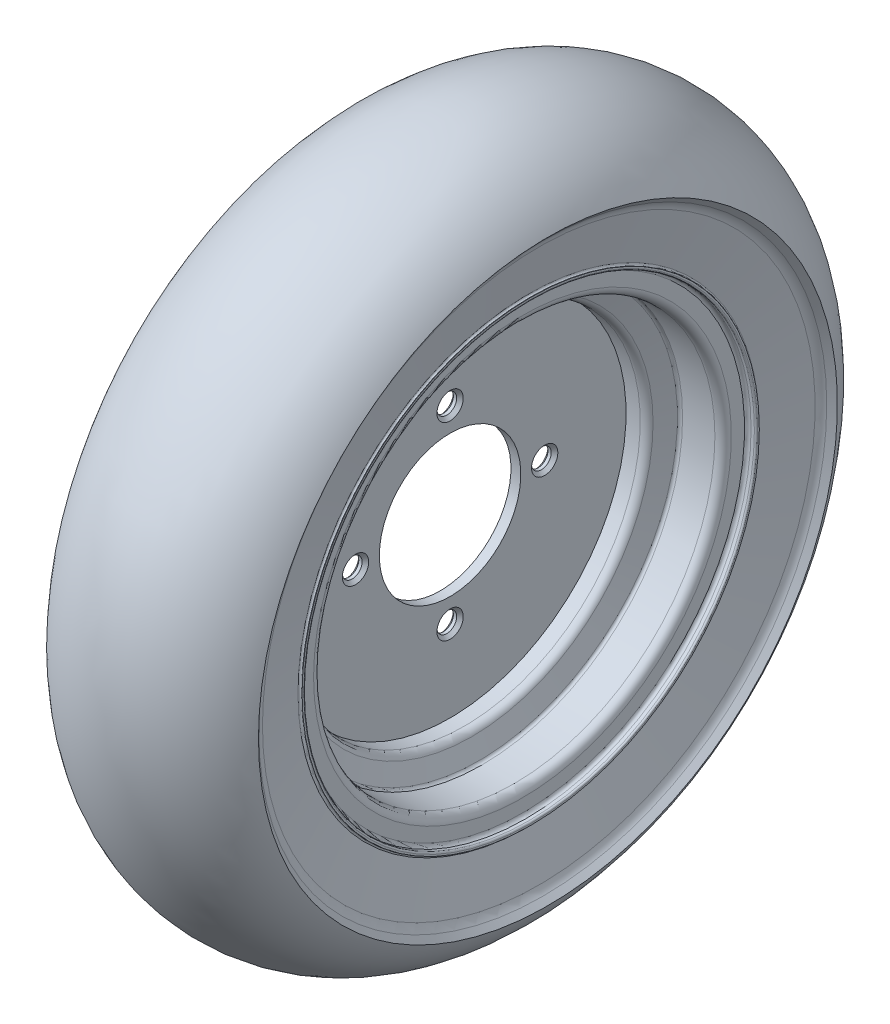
ISO-10303-21;
HEADER;
FILE_DESCRIPTION(('STEP AP214'),'2;1');
FILE_NAME('part.step','',(''),(''),'','','');
FILE_SCHEMA(('AUTOMOTIVE_DESIGN { 1 0 10303 214 1 1 1 1 }'));
ENDSEC;
DATA;
#1=APPLICATION_CONTEXT('core data for automotive mechanical design processes');
#2=APPLICATION_PROTOCOL_DEFINITION('international standard','automotive_design',2000,#1);
#3=PRODUCT_CONTEXT('',#1,'mechanical');
#4=PRODUCT('Part','Part','',(#3));
#5=PRODUCT_RELATED_PRODUCT_CATEGORY('part','',(#4));
#6=PRODUCT_DEFINITION_FORMATION('','',#4);
#7=PRODUCT_DEFINITION_CONTEXT('part definition',#1,'design');
#8=PRODUCT_DEFINITION('design','',#6,#7);
#9=PRODUCT_DEFINITION_SHAPE('','',#8);
#10=(LENGTH_UNIT() NAMED_UNIT(*) SI_UNIT(.MILLI.,.METRE.));
#11=(NAMED_UNIT(*) PLANE_ANGLE_UNIT() SI_UNIT($,.RADIAN.));
#12=(NAMED_UNIT(*) SI_UNIT($,.STERADIAN.) SOLID_ANGLE_UNIT());
#13=UNCERTAINTY_MEASURE_WITH_UNIT(LENGTH_MEASURE(1.E-05),#10,'distance_accuracy_value','');
#14=(GEOMETRIC_REPRESENTATION_CONTEXT(3) GLOBAL_UNCERTAINTY_ASSIGNED_CONTEXT((#13)) GLOBAL_UNIT_ASSIGNED_CONTEXT((#10,
#11,#12)) REPRESENTATION_CONTEXT('',''));
#15=CARTESIAN_POINT('',(0.,0.,0.));
#16=DIRECTION('',(0.,0.,1.));
#17=DIRECTION('',(1.,0.,0.));
#18=AXIS2_PLACEMENT_3D('',#15,#16,#17);
#19=CARTESIAN_POINT('',(-3.00000000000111,107.,-3.33066907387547E-13));
#20=DIRECTION('',(1.,0.,0.));
#21=DIRECTION('',(0.,0.,-0.999999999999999));
#22=AXIS2_PLACEMENT_3D('',#19,#20,#21);
#23=PLANE('',#22);
#24=CARTESIAN_POINT('',(-3.00000000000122,57.4999999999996,-1.11022302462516E-13));
#25=DIRECTION('',(1.,0.,0.));
#26=DIRECTION('',(0.,0.,-0.999999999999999));
#27=AXIS2_PLACEMENT_3D('',#24,#25,#26);
#28=CIRCLE('',#27,8.00000000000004);
#29=CARTESIAN_POINT('',(-3.00000000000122,57.4999999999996,-8.00000000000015));
#30=VERTEX_POINT('',#29);
#31=EDGE_CURVE('E74',#30,#30,#28,.T.);
#32=ORIENTED_EDGE('',*,*,#31,.T.);
#33=EDGE_LOOP('',(#32));
#34=FACE_BOUND('',#33,.T.);
#35=CARTESIAN_POINT('',(-3.00000000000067,-2.77555756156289E-13,-57.5000000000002));
#36=DIRECTION('',(1.,0.,0.));
#37=DIRECTION('',(0.,0.,-0.999999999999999));
#38=AXIS2_PLACEMENT_3D('',#35,#36,#37);
#39=CIRCLE('',#38,8.00000000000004);
#40=CARTESIAN_POINT('',(-3.00000000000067,-2.72670774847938E-13,-65.5000000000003));
#41=VERTEX_POINT('',#40);
#42=EDGE_CURVE('E77',#41,#41,#39,.T.);
#43=ORIENTED_EDGE('',*,*,#42,.T.);
#44=EDGE_LOOP('',(#43));
#45=FACE_BOUND('',#44,.T.);
#46=CARTESIAN_POINT('',(-3.00000000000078,-57.5,-2.22044604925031E-13));
#47=DIRECTION('',(1.,0.,0.));
#48=DIRECTION('',(0.,0.,-0.999999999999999));
#49=AXIS2_PLACEMENT_3D('',#46,#47,#48);
#50=CIRCLE('',#49,8.00000000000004);
#51=CARTESIAN_POINT('',(-3.00000000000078,-57.5,-8.00000000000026));
#52=VERTEX_POINT('',#51);
#53=EDGE_CURVE('E80',#52,#52,#50,.T.);
#54=ORIENTED_EDGE('',*,*,#53,.T.);
#55=EDGE_LOOP('',(#54));
#56=FACE_BOUND('',#55,.T.);
#57=CARTESIAN_POINT('',(-3.00000000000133,-4.44089209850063E-13,57.4999999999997));
#58=DIRECTION('',(1.,0.,0.));
#59=DIRECTION('',(0.,0.,-0.999999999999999));
#60=AXIS2_PLACEMENT_3D('',#57,#58,#59);
#61=CIRCLE('',#60,8.00000000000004);
#62=CARTESIAN_POINT('',(-3.00000000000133,-4.39204228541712E-13,49.4999999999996));
#63=VERTEX_POINT('',#62);
#64=EDGE_CURVE('E83',#63,#63,#61,.T.);
#65=ORIENTED_EDGE('',*,*,#64,.T.);
#66=EDGE_LOOP('',(#65));
#67=FACE_BOUND('',#66,.T.);
#68=CARTESIAN_POINT('',(-3.00000000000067,-1.94289029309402E-13,-2.22044604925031E-13));
#69=DIRECTION('',(-1.,0.,0.));
#70=DIRECTION('',(0.,0.,0.999999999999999));
#71=AXIS2_PLACEMENT_3D('',#68,#69,#70);
#72=CIRCLE('',#71,43.);
#73=CARTESIAN_POINT('',(-3.00000000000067,-2.20545803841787E-13,42.9999999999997));
#74=VERTEX_POINT('',#73);
#75=EDGE_CURVE('E86',#74,#74,#72,.T.);
#76=ORIENTED_EDGE('',*,*,#75,.F.);
#77=EDGE_LOOP('',(#76));
#78=FACE_BOUND('',#77,.T.);
#79=CARTESIAN_POINT('',(-3.00000000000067,-1.94289029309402E-13,-2.22044604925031E-13));
#80=DIRECTION('',(-1.,0.,0.));
#81=DIRECTION('',(0.,0.,0.999999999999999));
#82=AXIS2_PLACEMENT_3D('',#79,#80,#81);
#83=CIRCLE('',#82,107.);
#84=CARTESIAN_POINT('',(-3.00000000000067,-2.59625654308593E-13,107.));
#85=VERTEX_POINT('',#84);
#86=EDGE_CURVE('E89',#85,#85,#83,.T.);
#87=ORIENTED_EDGE('',*,*,#86,.T.);
#88=EDGE_LOOP('',(#87));
#89=FACE_BOUND('',#88,.T.);
#90=ADVANCED_FACE('F30',(#34,#45,#56,#67,#78,#89),#23,.F.);
#91=CARTESIAN_POINT('',(2.99999999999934,107.,-3.33066907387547E-13));
#92=DIRECTION('',(-1.,0.,0.));
#93=DIRECTION('',(0.,0.,-0.999999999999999));
#94=AXIS2_PLACEMENT_3D('',#91,#92,#93);
#95=PLANE('',#94);
#96=CARTESIAN_POINT('',(3.00000000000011,-57.5,-1.11022302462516E-13));
#97=DIRECTION('',(-1.,0.,0.));
#98=DIRECTION('',(0.,0.,0.999999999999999));
#99=AXIS2_PLACEMENT_3D('',#96,#97,#98);
#100=CIRCLE('',#99,8.00000000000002);
#101=CARTESIAN_POINT('',(3.00000000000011,-57.5,7.9999999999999));
#102=VERTEX_POINT('',#101);
#103=EDGE_CURVE('E50',#102,#102,#100,.T.);
#104=ORIENTED_EDGE('',*,*,#103,.T.);
#105=EDGE_LOOP('',(#104));
#106=FACE_BOUND('',#105,.T.);
#107=CARTESIAN_POINT('',(3.00000000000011,0.,-57.5));
#108=DIRECTION('',(-1.,0.,0.));
#109=DIRECTION('',(0.,0.,0.999999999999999));
#110=AXIS2_PLACEMENT_3D('',#107,#108,#109);
#111=CIRCLE('',#110,8.00000000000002);
#112=CARTESIAN_POINT('',(3.00000000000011,0.,-49.5));
#113=VERTEX_POINT('',#112);
#114=EDGE_CURVE('E53',#113,#113,#111,.T.);
#115=ORIENTED_EDGE('',*,*,#114,.T.);
#116=EDGE_LOOP('',(#115));
#117=FACE_BOUND('',#116,.T.);
#118=CARTESIAN_POINT('',(3.00000000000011,57.5,-3.33066907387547E-13));
#119=DIRECTION('',(-1.,0.,0.));
#120=DIRECTION('',(0.,0.,0.999999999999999));
#121=AXIS2_PLACEMENT_3D('',#118,#119,#120);
#122=CIRCLE('',#121,8.00000000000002);
#123=CARTESIAN_POINT('',(3.00000000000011,57.5,7.99999999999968));
#124=VERTEX_POINT('',#123);
#125=EDGE_CURVE('E56',#124,#124,#122,.T.);
#126=ORIENTED_EDGE('',*,*,#125,.T.);
#127=EDGE_LOOP('',(#126));
#128=FACE_BOUND('',#127,.T.);
#129=CARTESIAN_POINT('',(2.99999999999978,-1.94289029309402E-13,57.5));
#130=DIRECTION('',(-1.,0.,0.));
#131=DIRECTION('',(0.,0.,0.999999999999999));
#132=AXIS2_PLACEMENT_3D('',#129,#130,#131);
#133=CIRCLE('',#132,8.00000000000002);
#134=CARTESIAN_POINT('',(2.99999999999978,-1.99174010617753E-13,65.5));
#135=VERTEX_POINT('',#134);
#136=EDGE_CURVE('E59',#135,#135,#133,.T.);
#137=ORIENTED_EDGE('',*,*,#136,.T.);
#138=EDGE_LOOP('',(#137));
#139=FACE_BOUND('',#138,.T.);
#140=CARTESIAN_POINT('',(2.99999999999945,-2.77555756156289E-13,-3.33066907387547E-13));
#141=DIRECTION('',(-1.,0.,0.));
#142=DIRECTION('',(0.,0.,0.999999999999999));
#143=AXIS2_PLACEMENT_3D('',#140,#141,#142);
#144=CIRCLE('',#143,43.);
#145=CARTESIAN_POINT('',(2.99999999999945,-3.03812530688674E-13,42.9999999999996));
#146=VERTEX_POINT('',#145);
#147=EDGE_CURVE('E140',#146,#146,#144,.T.);
#148=ORIENTED_EDGE('',*,*,#147,.T.);
#149=EDGE_LOOP('',(#148));
#150=FACE_BOUND('',#149,.T.);
#151=CARTESIAN_POINT('',(2.99999999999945,-2.77555756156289E-13,-3.33066907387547E-13));
#152=DIRECTION('',(-1.,0.,0.));
#153=DIRECTION('',(0.,0.,0.999999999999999));
#154=AXIS2_PLACEMENT_3D('',#151,#152,#153);
#155=CIRCLE('',#154,107.);
#156=CARTESIAN_POINT('',(2.99999999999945,-3.4289238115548E-13,107.));
#157=VERTEX_POINT('',#156);
#158=EDGE_CURVE('E143',#157,#157,#155,.T.);
#159=ORIENTED_EDGE('',*,*,#158,.F.);
#160=EDGE_LOOP('',(#159));
#161=FACE_BOUND('',#160,.T.);
#162=ADVANCED_FACE('F213',(#106,#117,#128,#139,#150,#161),#95,.F.);
#163=CARTESIAN_POINT('',(-84.178122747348,-2.77555756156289E-13,-2.22044604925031E-13));
#164=DIRECTION('',(-1.,0.,0.));
#165=DIRECTION('',(0.,0.,0.999999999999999));
#166=AXIS2_PLACEMENT_3D('',#163,#164,#165);
#167=CYLINDRICAL_SURFACE('',#166,43.);
#168=ORIENTED_EDGE('',*,*,#75,.T.);
#169=EDGE_LOOP('',(#168));
#170=FACE_BOUND('',#169,.T.);
#171=ORIENTED_EDGE('',*,*,#147,.F.);
#172=EDGE_LOOP('',(#171));
#173=FACE_BOUND('',#172,.T.);
#174=ADVANCED_FACE('F32',(#170,#173),#167,.F.);
#175=CARTESIAN_POINT('',(-84.178122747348,-2.77555756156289E-13,-2.22044604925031E-13));
#176=DIRECTION('',(-1.,0.,0.));
#177=DIRECTION('',(0.,0.,0.999999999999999));
#178=AXIS2_PLACEMENT_3D('',#175,#176,#177);
#179=CYLINDRICAL_SURFACE('',#178,107.);
#180=ORIENTED_EDGE('',*,*,#86,.F.);
#181=EDGE_LOOP('',(#180));
#182=FACE_BOUND('',#181,.T.);
#183=CARTESIAN_POINT('',(-11.6148351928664,0.,-4.44089209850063E-13));
#184=DIRECTION('',(-1.,0.,0.));
#185=DIRECTION('',(0.,0.,0.999999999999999));
#186=AXIS2_PLACEMENT_3D('',#183,#184,#185);
#187=CIRCLE('',#186,107.);
#188=CARTESIAN_POINT('',(-11.6148351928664,0.,106.999999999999));
#189=VERTEX_POINT('',#188);
#190=EDGE_CURVE('E92',#189,#189,#187,.T.);
#191=ORIENTED_EDGE('',*,*,#190,.T.);
#192=EDGE_LOOP('',(#191));
#193=FACE_BOUND('',#192,.T.);
#194=ADVANCED_FACE('F222',(#182,#193),#179,.F.);
#195=CARTESIAN_POINT('',(-11.6148351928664,0.,-4.44089209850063E-13));
#196=DIRECTION('',(-1.,0.,0.));
#197=DIRECTION('',(0.,0.,0.999999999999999));
#198=AXIS2_PLACEMENT_3D('',#195,#196,#197);
#199=TOROIDAL_SURFACE('',#198,112.,5.);
#200=CARTESIAN_POINT('',(-16.2572186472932,0.,-2.22044604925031E-13));
#201=DIRECTION('',(-1.,0.,0.));
#202=DIRECTION('',(0.,0.,0.999999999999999));
#203=AXIS2_PLACEMENT_3D('',#200,#201,#202);
#204=CIRCLE('',#203,110.143046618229);
#205=CARTESIAN_POINT('',(-16.2572186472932,0.,110.143046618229));
#206=VERTEX_POINT('',#205);
#207=EDGE_CURVE('E95',#206,#206,#204,.T.);
#208=ORIENTED_EDGE('',*,*,#207,.T.);
#209=EDGE_LOOP('',(#208));
#210=FACE_BOUND('',#209,.T.);
#211=ORIENTED_EDGE('',*,*,#190,.F.);
#212=EDGE_LOOP('',(#211));
#213=FACE_BOUND('',#212,.T.);
#214=ADVANCED_FACE('F225',(#210,#213),#199,.T.);
#215=CARTESIAN_POINT('',(-20.497112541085,-3.05311331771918E-13,-1.11022302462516E-13));
#216=DIRECTION('',(-1.,0.,0.));
#217=DIRECTION('',(0.,0.,0.999999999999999));
#218=AXIS2_PLACEMENT_3D('',#215,#216,#217);
#219=CONICAL_SURFACE('',#218,120.742781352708,1.19028994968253);
#220=ORIENTED_EDGE('',*,*,#207,.F.);
#221=EDGE_LOOP('',(#220));
#222=FACE_BOUND('',#221,.T.);
#223=CARTESIAN_POINT('',(-20.497112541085,-3.05311331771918E-13,-1.11022302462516E-13));
#224=DIRECTION('',(-1.,0.,0.));
#225=DIRECTION('',(0.,0.,0.999999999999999));
#226=AXIS2_PLACEMENT_3D('',#223,#224,#225);
#227=CIRCLE('',#226,120.742781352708);
#228=CARTESIAN_POINT('',(-20.497112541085,-3.790396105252E-13,120.742781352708));
#229=VERTEX_POINT('',#228);
#230=EDGE_CURVE('E98',#229,#229,#227,.T.);
#231=ORIENTED_EDGE('',*,*,#230,.T.);
#232=EDGE_LOOP('',(#231));
#233=FACE_BOUND('',#232,.T.);
#234=ADVANCED_FACE('F229',(#222,#233),#219,.F.);
#235=CARTESIAN_POINT('',(-22.3540659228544,-2.4980018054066E-13,-1.11022302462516E-13));
#236=DIRECTION('',(-1.,0.,0.));
#237=DIRECTION('',(0.,0.,0.999999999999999));
#238=AXIS2_PLACEMENT_3D('',#235,#236,#237);
#239=TOROIDAL_SURFACE('',#238,120.,2.);
#240=CARTESIAN_POINT('',(-22.3540659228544,-2.4980018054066E-13,-1.11022302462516E-13));
#241=DIRECTION('',(-1.,0.,0.));
#242=DIRECTION('',(0.,0.,0.999999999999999));
#243=AXIS2_PLACEMENT_3D('',#240,#241,#242);
#244=CIRCLE('',#243,122.);
#245=CARTESIAN_POINT('',(-22.3540659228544,-3.24296145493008E-13,122.));
#246=VERTEX_POINT('',#245);
#247=EDGE_CURVE('E101',#246,#246,#244,.T.);
#248=ORIENTED_EDGE('',*,*,#247,.T.);
#249=EDGE_LOOP('',(#248));
#250=FACE_BOUND('',#249,.T.);
#251=ORIENTED_EDGE('',*,*,#230,.F.);
#252=EDGE_LOOP('',(#251));
#253=FACE_BOUND('',#252,.T.);
#254=ADVANCED_FACE('F233',(#250,#253),#239,.F.);
#255=CARTESIAN_POINT('',(-84.178122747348,-2.77555756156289E-13,-2.22044604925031E-13));
#256=DIRECTION('',(-1.,0.,0.));
#257=DIRECTION('',(0.,0.,0.999999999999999));
#258=AXIS2_PLACEMENT_3D('',#255,#256,#257);
#259=CYLINDRICAL_SURFACE('',#258,122.);
#260=ORIENTED_EDGE('',*,*,#247,.F.);
#261=EDGE_LOOP('',(#260));
#262=FACE_BOUND('',#261,.T.);
#263=CARTESIAN_POINT('',(-42.000000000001,-2.22044604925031E-13,-3.33066907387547E-13));
#264=DIRECTION('',(-1.,0.,0.));
#265=DIRECTION('',(0.,0.,0.999999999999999));
#266=AXIS2_PLACEMENT_3D('',#263,#264,#265);
#267=CIRCLE('',#266,122.);
#268=CARTESIAN_POINT('',(-42.000000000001,-2.96540569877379E-13,122.));
#269=VERTEX_POINT('',#268);
#270=EDGE_CURVE('E104',#269,#269,#267,.T.);
#271=ORIENTED_EDGE('',*,*,#270,.T.);
#272=EDGE_LOOP('',(#271));
#273=FACE_BOUND('',#272,.T.);
#274=ADVANCED_FACE('F237',(#262,#273),#259,.F.);
#275=CARTESIAN_POINT('',(-42.000000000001,-2.22044604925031E-13,-3.33066907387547E-13));
#276=DIRECTION('',(-1.,0.,0.));
#277=DIRECTION('',(0.,0.,0.999999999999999));
#278=AXIS2_PLACEMENT_3D('',#275,#276,#277);
#279=TOROIDAL_SURFACE('',#278,127.,4.99999999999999);
#280=CARTESIAN_POINT('',(-47.0000000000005,-1.94289029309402E-13,0.));
#281=DIRECTION('',(-1.,0.,0.));
#282=DIRECTION('',(0.,0.,0.999999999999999));
#283=AXIS2_PLACEMENT_3D('',#280,#281,#282);
#284=CIRCLE('',#283,127.);
#285=CARTESIAN_POINT('',(-47.0000000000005,-2.7183810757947E-13,127.));
#286=VERTEX_POINT('',#285);
#287=EDGE_CURVE('E107',#286,#286,#284,.T.);
#288=ORIENTED_EDGE('',*,*,#287,.T.);
#289=EDGE_LOOP('',(#288));
#290=FACE_BOUND('',#289,.T.);
#291=ORIENTED_EDGE('',*,*,#270,.F.);
#292=EDGE_LOOP('',(#291));
#293=FACE_BOUND('',#292,.T.);
#294=ADVANCED_FACE('F241',(#290,#293),#279,.T.);
#295=CARTESIAN_POINT('',(-47.0000000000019,135.,-4.44089209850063E-13));
#296=DIRECTION('',(1.,0.,0.));
#297=DIRECTION('',(0.,0.,-0.999999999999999));
#298=AXIS2_PLACEMENT_3D('',#295,#296,#297);
#299=PLANE('',#298);
#300=ORIENTED_EDGE('',*,*,#287,.F.);
#301=EDGE_LOOP('',(#300));
#302=FACE_BOUND('',#301,.T.);
#303=CARTESIAN_POINT('',(-47.0000000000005,-1.94289029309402E-13,0.));
#304=DIRECTION('',(-1.,0.,0.));
#305=DIRECTION('',(0.,0.,0.999999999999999));
#306=AXIS2_PLACEMENT_3D('',#303,#304,#305);
#307=CIRCLE('',#306,135.);
#308=CARTESIAN_POINT('',(-47.0000000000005,-2.7672308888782E-13,135.));
#309=VERTEX_POINT('',#308);
#310=EDGE_CURVE('E110',#309,#309,#307,.T.);
#311=ORIENTED_EDGE('',*,*,#310,.T.);
#312=EDGE_LOOP('',(#311));
#313=FACE_BOUND('',#312,.T.);
#314=ADVANCED_FACE('F245',(#302,#313),#299,.F.);
#315=CARTESIAN_POINT('',(-49.0000000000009,0.,-1.11022302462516E-13));
#316=DIRECTION('',(-1.,0.,0.));
#317=DIRECTION('',(0.,0.,0.999999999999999));
#318=AXIS2_PLACEMENT_3D('',#315,#316,#317);
#319=TOROIDAL_SURFACE('',#318,135.,2.00000000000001);
#320=CARTESIAN_POINT('',(-49.0000000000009,0.,-1.11022302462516E-13));
#321=DIRECTION('',(-1.,0.,0.));
#322=DIRECTION('',(0.,0.,0.999999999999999));
#323=AXIS2_PLACEMENT_3D('',#320,#321,#322);
#324=CIRCLE('',#323,137.);
#325=CARTESIAN_POINT('',(-49.0000000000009,-1.11410880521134E-13,137.));
#326=VERTEX_POINT('',#325);
#327=EDGE_CURVE('E113',#326,#326,#324,.T.);
#328=ORIENTED_EDGE('',*,*,#327,.T.);
#329=EDGE_LOOP('',(#328));
#330=FACE_BOUND('',#329,.T.);
#331=ORIENTED_EDGE('',*,*,#310,.F.);
#332=EDGE_LOOP('',(#331));
#333=FACE_BOUND('',#332,.T.);
#334=ADVANCED_FACE('F249',(#330,#333),#319,.F.);
#335=CARTESIAN_POINT('',(-84.178122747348,-2.77555756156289E-13,-2.22044604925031E-13));
#336=DIRECTION('',(-1.,0.,0.));
#337=DIRECTION('',(0.,0.,0.999999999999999));
#338=AXIS2_PLACEMENT_3D('',#335,#336,#337);
#339=CYLINDRICAL_SURFACE('',#338,137.);
#340=ORIENTED_EDGE('',*,*,#327,.F.);
#341=EDGE_LOOP('',(#340));
#342=FACE_BOUND('',#341,.T.);
#343=CARTESIAN_POINT('',(-51.0000000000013,-2.22044604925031E-13,-2.22044604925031E-13));
#344=DIRECTION('',(-1.,0.,0.));
#345=DIRECTION('',(0.,0.,0.999999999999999));
#346=AXIS2_PLACEMENT_3D('',#343,#344,#345);
#347=CIRCLE('',#346,137.);
#348=CARTESIAN_POINT('',(-51.0000000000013,-3.05699909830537E-13,137.));
#349=VERTEX_POINT('',#348);
#350=EDGE_CURVE('E116',#349,#349,#347,.T.);
#351=ORIENTED_EDGE('',*,*,#350,.T.);
#352=EDGE_LOOP('',(#351));
#353=FACE_BOUND('',#352,.T.);
#354=ADVANCED_FACE('F253',(#342,#353),#339,.F.);
#355=CARTESIAN_POINT('',(-51.0000000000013,-2.22044604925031E-13,-2.22044604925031E-13));
#356=DIRECTION('',(-1.,0.,0.));
#357=DIRECTION('',(0.,0.,0.999999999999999));
#358=AXIS2_PLACEMENT_3D('',#355,#356,#357);
#359=TOROIDAL_SURFACE('',#358,138.,1.);
#360=CARTESIAN_POINT('',(-52.0000000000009,0.,0.));
#361=DIRECTION('',(-1.,0.,0.));
#362=DIRECTION('',(0.,0.,0.999999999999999));
#363=AXIS2_PLACEMENT_3D('',#360,#361,#362);
#364=CIRCLE('',#363,138.);
#365=CARTESIAN_POINT('',(-52.0000000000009,0.,138.));
#366=VERTEX_POINT('',#365);
#367=EDGE_CURVE('E119',#366,#366,#364,.T.);
#368=ORIENTED_EDGE('',*,*,#367,.T.);
#369=EDGE_LOOP('',(#368));
#370=FACE_BOUND('',#369,.T.);
#371=ORIENTED_EDGE('',*,*,#350,.F.);
#372=EDGE_LOOP('',(#371));
#373=FACE_BOUND('',#372,.T.);
#374=ADVANCED_FACE('F257',(#370,#373),#359,.T.);
#375=CARTESIAN_POINT('',(-52.0000000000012,139.,-4.44089209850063E-13));
#376=DIRECTION('',(1.,0.,0.));
#377=DIRECTION('',(0.,0.,-0.999999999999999));
#378=AXIS2_PLACEMENT_3D('',#375,#376,#377);
#379=PLANE('',#378);
#380=ORIENTED_EDGE('',*,*,#367,.F.);
#381=EDGE_LOOP('',(#380));
#382=FACE_BOUND('',#381,.T.);
#383=CARTESIAN_POINT('',(-52.0000000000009,0.,0.));
#384=DIRECTION('',(-1.,0.,0.));
#385=DIRECTION('',(0.,0.,0.999999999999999));
#386=AXIS2_PLACEMENT_3D('',#383,#384,#385);
#387=CIRCLE('',#386,139.);
#388=CARTESIAN_POINT('',(-52.0000000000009,0.,139.));
#389=VERTEX_POINT('',#388);
#390=EDGE_CURVE('E122',#389,#389,#387,.T.);
#391=ORIENTED_EDGE('',*,*,#390,.T.);
#392=EDGE_LOOP('',(#391));
#393=FACE_BOUND('',#392,.T.);
#394=ADVANCED_FACE('F261',(#382,#393),#379,.F.);
#395=CARTESIAN_POINT('',(-84.178122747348,-2.77555756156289E-13,-2.22044604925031E-13));
#396=DIRECTION('',(-1.,0.,0.));
#397=DIRECTION('',(0.,0.,0.999999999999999));
#398=AXIS2_PLACEMENT_3D('',#395,#396,#397);
#399=CYLINDRICAL_SURFACE('',#398,139.);
#400=ORIENTED_EDGE('',*,*,#390,.F.);
#401=EDGE_LOOP('',(#400));
#402=FACE_BOUND('',#401,.T.);
#403=CARTESIAN_POINT('',(-51.6998749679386,-3.60822483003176E-13,-3.33066907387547E-13));
#404=DIRECTION('',(-1.,0.,0.));
#405=DIRECTION('',(0.,0.,0.999999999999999));
#406=AXIS2_PLACEMENT_3D('',#403,#404,#405);
#407=CIRCLE('',#406,139.);
#408=CARTESIAN_POINT('',(-51.6998749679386,-4.45699033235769E-13,139.));
#409=VERTEX_POINT('',#408);
#410=EDGE_CURVE('E125',#409,#409,#407,.T.);
#411=ORIENTED_EDGE('',*,*,#410,.T.);
#412=EDGE_LOOP('',(#411));
#413=FACE_BOUND('',#412,.T.);
#414=ADVANCED_FACE('F265',(#402,#413),#399,.T.);
#415=CARTESIAN_POINT('',(-51.6998749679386,-3.60822483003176E-13,-3.33066907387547E-13));
#416=DIRECTION('',(-1.,0.,0.));
#417=DIRECTION('',(0.,0.,0.999999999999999));
#418=AXIS2_PLACEMENT_3D('',#415,#416,#417);
#419=TOROIDAL_SURFACE('',#418,140.,0.999999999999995);
#420=ORIENTED_EDGE('',*,*,#410,.F.);
#421=EDGE_LOOP('',(#420));
#422=FACE_BOUND('',#421,.T.);
#423=CARTESIAN_POINT('',(-50.7238932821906,-2.22044604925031E-13,-4.44089209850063E-13));
#424=DIRECTION('',(-1.,0.,0.));
#425=DIRECTION('',(0.,0.,0.999999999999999));
#426=AXIS2_PLACEMENT_3D('',#423,#424,#425);
#427=CIRCLE('',#426,140.217852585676);
#428=CARTESIAN_POINT('',(-50.7238932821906,-3.07664803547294E-13,140.217852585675));
#429=VERTEX_POINT('',#428);
#430=EDGE_CURVE('E128',#429,#429,#427,.T.);
#431=ORIENTED_EDGE('',*,*,#430,.T.);
#432=EDGE_LOOP('',(#431));
#433=FACE_BOUND('',#432,.T.);
#434=ADVANCED_FACE('F269',(#422,#433),#419,.F.);
#435=CARTESIAN_POINT('',(-56.9240640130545,0.,-4.44089209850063E-13));
#436=DIRECTION('',(-1.,0.,0.));
#437=DIRECTION('',(0.,0.,0.999999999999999));
#438=AXIS2_PLACEMENT_3D('',#435,#436,#437);
#439=CONICAL_SURFACE('',#438,167.994677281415,1.35118265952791);
#440=ORIENTED_EDGE('',*,*,#430,.F.);
#441=EDGE_LOOP('',(#440));
#442=FACE_BOUND('',#441,.T.);
#443=CARTESIAN_POINT('',(-56.9240640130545,0.,-4.44089209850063E-13));
#444=DIRECTION('',(-1.,0.,0.));
#445=DIRECTION('',(0.,0.,0.999999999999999));
#446=AXIS2_PLACEMENT_3D('',#443,#444,#445);
#447=CIRCLE('',#446,167.994677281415);
#448=CARTESIAN_POINT('',(-56.9240640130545,0.,167.994677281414));
#449=VERTEX_POINT('',#448);
#450=EDGE_CURVE('E131',#449,#449,#447,.T.);
#451=ORIENTED_EDGE('',*,*,#450,.T.);
#452=EDGE_LOOP('',(#451));
#453=FACE_BOUND('',#452,.T.);
#454=ADVANCED_FACE('F273',(#442,#453),#439,.F.);
#455=CARTESIAN_POINT('',(-66.6838808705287,-3.60822483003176E-13,-3.33066907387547E-13));
#456=DIRECTION('',(-1.,0.,0.));
#457=DIRECTION('',(0.,0.,0.999999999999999));
#458=AXIS2_PLACEMENT_3D('',#455,#456,#457);
#459=TOROIDAL_SURFACE('',#458,165.816151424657,10.);
#460=CARTESIAN_POINT('',(-59.3625435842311,0.,-1.11022302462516E-13));
#461=DIRECTION('',(-1.,0.,0.));
#462=DIRECTION('',(0.,0.,0.999999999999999));
#463=AXIS2_PLACEMENT_3D('',#460,#461,#462);
#464=CIRCLE('',#463,172.62776065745);
#465=CARTESIAN_POINT('',(-59.3625435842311,-1.0541042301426E-13,172.62776065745));
#466=VERTEX_POINT('',#465);
#467=EDGE_CURVE('E134',#466,#466,#464,.T.);
#468=ORIENTED_EDGE('',*,*,#467,.T.);
#469=EDGE_LOOP('',(#468));
#470=FACE_BOUND('',#469,.T.);
#471=ORIENTED_EDGE('',*,*,#450,.F.);
#472=EDGE_LOOP('',(#471));
#473=FACE_BOUND('',#472,.T.);
#474=ADVANCED_FACE('F277',(#470,#473),#459,.F.);
#475=CARTESIAN_POINT('',(-62.5000000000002,0.,-2.22044604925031E-13));
#476=DIRECTION('',(-1.,0.,0.));
#477=DIRECTION('',(0.,0.,0.999999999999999));
#478=AXIS2_PLACEMENT_3D('',#475,#476,#477);
#479=CONICAL_SURFACE('',#478,176.,0.821449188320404);
#480=ORIENTED_EDGE('',*,*,#467,.F.);
#481=EDGE_LOOP('',(#480));
#482=FACE_BOUND('',#481,.T.);
#483=CARTESIAN_POINT('',(-62.5000000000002,0.,-2.22044604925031E-13));
#484=DIRECTION('',(-1.,0.,0.));
#485=DIRECTION('',(0.,0.,0.999999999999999));
#486=AXIS2_PLACEMENT_3D('',#483,#484,#485);
#487=CIRCLE('',#486,176.);
#488=CARTESIAN_POINT('',(-62.5000000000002,-1.07469588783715E-13,176.));
#489=VERTEX_POINT('',#488);
#490=EDGE_CURVE('E137',#489,#489,#487,.T.);
#491=ORIENTED_EDGE('',*,*,#490,.T.);
#492=EDGE_LOOP('',(#491));
#493=FACE_BOUND('',#492,.T.);
#494=ADVANCED_FACE('F281',(#482,#493),#479,.F.);
#495=CARTESIAN_POINT('',(1.11022302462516E-13,0.,0.));
#496=DIRECTION('',(-1.,0.,0.));
#497=DIRECTION('',(0.,0.,0.999999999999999));
#498=AXIS2_PLACEMENT_3D('',#495,#496,#497);
#499=TOROIDAL_SURFACE('',#498,141.069949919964,71.5985921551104);
#500=ORIENTED_EDGE('',*,*,#490,.F.);
#501=EDGE_LOOP('',(#500));
#502=FACE_BOUND('',#501,.T.);
#503=CARTESIAN_POINT('',(62.4999999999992,-1.66533453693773E-13,-1.11022302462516E-13));
#504=DIRECTION('',(-1.,0.,0.));
#505=DIRECTION('',(0.,0.,0.999999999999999));
#506=AXIS2_PLACEMENT_3D('',#503,#504,#505);
#507=CIRCLE('',#506,176.);
#508=CARTESIAN_POINT('',(62.4999999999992,-2.74003042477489E-13,176.));
#509=VERTEX_POINT('',#508);
#510=EDGE_CURVE('E191',#509,#509,#507,.T.);
#511=ORIENTED_EDGE('',*,*,#510,.T.);
#512=EDGE_LOOP('',(#511));
#513=FACE_BOUND('',#512,.T.);
#514=ADVANCED_FACE('F195',(#502,#513),#499,.T.);
#515=CARTESIAN_POINT('',(84.1781227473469,-2.77555756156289E-13,-3.33066907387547E-13));
#516=DIRECTION('',(1.,0.,0.));
#517=DIRECTION('',(0.,0.,0.999999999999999));
#518=AXIS2_PLACEMENT_3D('',#515,#516,#517);
#519=CYLINDRICAL_SURFACE('',#518,107.);
#520=ORIENTED_EDGE('',*,*,#158,.T.);
#521=EDGE_LOOP('',(#520));
#522=FACE_BOUND('',#521,.T.);
#523=CARTESIAN_POINT('',(11.6148351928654,-2.22044604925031E-13,-1.11022302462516E-13));
#524=DIRECTION('',(-1.,0.,0.));
#525=DIRECTION('',(0.,0.,0.999999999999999));
#526=AXIS2_PLACEMENT_3D('',#523,#524,#525);
#527=CIRCLE('',#526,107.);
#528=CARTESIAN_POINT('',(11.6148351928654,-2.87381229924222E-13,107.));
#529=VERTEX_POINT('',#528);
#530=EDGE_CURVE('E146',#529,#529,#527,.T.);
#531=ORIENTED_EDGE('',*,*,#530,.F.);
#532=EDGE_LOOP('',(#531));
#533=FACE_BOUND('',#532,.T.);
#534=ADVANCED_FACE('F287',(#522,#533),#519,.F.);
#535=CARTESIAN_POINT('',(11.6148351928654,-2.22044604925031E-13,-1.11022302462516E-13));
#536=DIRECTION('',(1.,0.,0.));
#537=DIRECTION('',(0.,0.,0.999999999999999));
#538=AXIS2_PLACEMENT_3D('',#535,#536,#537);
#539=TOROIDAL_SURFACE('',#538,112.,5.);
#540=CARTESIAN_POINT('',(16.2572186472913,-2.22044604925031E-13,-4.44089209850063E-13));
#541=DIRECTION('',(-1.,0.,0.));
#542=DIRECTION('',(0.,0.,0.999999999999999));
#543=AXIS2_PLACEMENT_3D('',#540,#541,#542);
#544=CIRCLE('',#543,110.143046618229);
#545=CARTESIAN_POINT('',(16.2572186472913,-2.89300445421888E-13,110.143046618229));
#546=VERTEX_POINT('',#545);
#547=EDGE_CURVE('E149',#546,#546,#544,.T.);
#548=ORIENTED_EDGE('',*,*,#547,.F.);
#549=EDGE_LOOP('',(#548));
#550=FACE_BOUND('',#549,.T.);
#551=ORIENTED_EDGE('',*,*,#530,.T.);
#552=EDGE_LOOP('',(#551));
#553=FACE_BOUND('',#552,.T.);
#554=ADVANCED_FACE('F292',(#550,#553),#539,.T.);
#555=CARTESIAN_POINT('',(20.4971125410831,-1.11022302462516E-13,-2.22044604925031E-13));
#556=DIRECTION('',(1.,0.,0.));
#557=DIRECTION('',(0.,0.,0.999999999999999));
#558=AXIS2_PLACEMENT_3D('',#555,#556,#557);
#559=CONICAL_SURFACE('',#558,120.742781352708,1.19028994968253);
#560=ORIENTED_EDGE('',*,*,#547,.T.);
#561=EDGE_LOOP('',(#560));
#562=FACE_BOUND('',#561,.T.);
#563=CARTESIAN_POINT('',(20.4971125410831,-1.11022302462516E-13,-2.22044604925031E-13));
#564=DIRECTION('',(-1.,0.,0.));
#565=DIRECTION('',(0.,0.,0.999999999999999));
#566=AXIS2_PLACEMENT_3D('',#563,#564,#565);
#567=CIRCLE('',#566,120.742781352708);
#568=CARTESIAN_POINT('',(20.4971125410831,-1.84750581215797E-13,120.742781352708));
#569=VERTEX_POINT('',#568);
#570=EDGE_CURVE('E152',#569,#569,#567,.T.);
#571=ORIENTED_EDGE('',*,*,#570,.F.);
#572=EDGE_LOOP('',(#571));
#573=FACE_BOUND('',#572,.T.);
#574=ADVANCED_FACE('F296',(#562,#573),#559,.F.);
#575=CARTESIAN_POINT('',(22.3540659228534,-3.05311331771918E-13,-2.22044604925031E-13));
#576=DIRECTION('',(1.,0.,0.));
#577=DIRECTION('',(0.,0.,0.999999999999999));
#578=AXIS2_PLACEMENT_3D('',#575,#576,#577);
#579=TOROIDAL_SURFACE('',#578,120.,2.);
#580=CARTESIAN_POINT('',(22.3540659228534,-3.05311331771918E-13,-2.22044604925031E-13));
#581=DIRECTION('',(-1.,0.,0.));
#582=DIRECTION('',(0.,0.,0.999999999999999));
#583=AXIS2_PLACEMENT_3D('',#580,#581,#582);
#584=CIRCLE('',#583,122.);
#585=CARTESIAN_POINT('',(22.3540659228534,-3.79807296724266E-13,122.));
#586=VERTEX_POINT('',#585);
#587=EDGE_CURVE('E155',#586,#586,#584,.T.);
#588=ORIENTED_EDGE('',*,*,#587,.F.);
#589=EDGE_LOOP('',(#588));
#590=FACE_BOUND('',#589,.T.);
#591=ORIENTED_EDGE('',*,*,#570,.T.);
#592=EDGE_LOOP('',(#591));
#593=FACE_BOUND('',#592,.T.);
#594=ADVANCED_FACE('F300',(#590,#593),#579,.F.);
#595=CARTESIAN_POINT('',(84.1781227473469,-2.77555756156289E-13,-3.33066907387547E-13));
#596=DIRECTION('',(1.,0.,0.));
#597=DIRECTION('',(0.,0.,0.999999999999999));
#598=AXIS2_PLACEMENT_3D('',#595,#596,#597);
#599=CYLINDRICAL_SURFACE('',#598,122.);
#600=ORIENTED_EDGE('',*,*,#587,.T.);
#601=EDGE_LOOP('',(#600));
#602=FACE_BOUND('',#601,.T.);
#603=CARTESIAN_POINT('',(41.9999999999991,-1.11022302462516E-13,-3.33066907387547E-13));
#604=DIRECTION('',(-1.,0.,0.));
#605=DIRECTION('',(0.,0.,0.999999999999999));
#606=AXIS2_PLACEMENT_3D('',#603,#604,#605);
#607=CIRCLE('',#606,122.);
#608=CARTESIAN_POINT('',(41.9999999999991,-1.85518267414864E-13,122.));
#609=VERTEX_POINT('',#608);
#610=EDGE_CURVE('E158',#609,#609,#607,.T.);
#611=ORIENTED_EDGE('',*,*,#610,.F.);
#612=EDGE_LOOP('',(#611));
#613=FACE_BOUND('',#612,.T.);
#614=ADVANCED_FACE('F304',(#602,#613),#599,.F.);
#615=CARTESIAN_POINT('',(41.9999999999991,-1.11022302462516E-13,-3.33066907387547E-13));
#616=DIRECTION('',(1.,0.,0.));
#617=DIRECTION('',(0.,0.,0.999999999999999));
#618=AXIS2_PLACEMENT_3D('',#615,#616,#617);
#619=TOROIDAL_SURFACE('',#618,127.,4.99999999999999);
#620=CARTESIAN_POINT('',(46.9999999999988,-2.4980018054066E-13,-3.33066907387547E-13));
#621=DIRECTION('',(-1.,0.,0.));
#622=DIRECTION('',(0.,0.,0.999999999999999));
#623=AXIS2_PLACEMENT_3D('',#620,#621,#622);
#624=CIRCLE('',#623,127.);
#625=CARTESIAN_POINT('',(46.9999999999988,-3.27349258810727E-13,127.));
#626=VERTEX_POINT('',#625);
#627=EDGE_CURVE('E161',#626,#626,#624,.T.);
#628=ORIENTED_EDGE('',*,*,#627,.F.);
#629=EDGE_LOOP('',(#628));
#630=FACE_BOUND('',#629,.T.);
#631=ORIENTED_EDGE('',*,*,#610,.T.);
#632=EDGE_LOOP('',(#631));
#633=FACE_BOUND('',#632,.T.);
#634=ADVANCED_FACE('F308',(#630,#633),#619,.T.);
#635=CARTESIAN_POINT('',(47.,135.,-3.33066907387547E-13));
#636=DIRECTION('',(-1.,0.,0.));
#637=DIRECTION('',(0.,0.,-0.999999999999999));
#638=AXIS2_PLACEMENT_3D('',#635,#636,#637);
#639=PLANE('',#638);
#640=ORIENTED_EDGE('',*,*,#627,.T.);
#641=EDGE_LOOP('',(#640));
#642=FACE_BOUND('',#641,.T.);
#643=CARTESIAN_POINT('',(46.9999999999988,-2.4980018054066E-13,-3.33066907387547E-13));
#644=DIRECTION('',(-1.,0.,0.));
#645=DIRECTION('',(0.,0.,0.999999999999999));
#646=AXIS2_PLACEMENT_3D('',#643,#644,#645);
#647=CIRCLE('',#646,135.);
#648=CARTESIAN_POINT('',(46.9999999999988,-3.32234240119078E-13,135.));
#649=VERTEX_POINT('',#648);
#650=EDGE_CURVE('E164',#649,#649,#647,.T.);
#651=ORIENTED_EDGE('',*,*,#650,.F.);
#652=EDGE_LOOP('',(#651));
#653=FACE_BOUND('',#652,.T.);
#654=ADVANCED_FACE('F312',(#642,#653),#639,.F.);
#655=CARTESIAN_POINT('',(48.9999999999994,-1.11022302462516E-13,-1.11022302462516E-13));
#656=DIRECTION('',(1.,0.,0.));
#657=DIRECTION('',(0.,0.,0.999999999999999));
#658=AXIS2_PLACEMENT_3D('',#655,#656,#657);
#659=TOROIDAL_SURFACE('',#658,135.,2.00000000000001);
#660=CARTESIAN_POINT('',(48.9999999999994,-1.11022302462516E-13,-1.11022302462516E-13));
#661=DIRECTION('',(-1.,0.,0.));
#662=DIRECTION('',(0.,0.,0.999999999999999));
#663=AXIS2_PLACEMENT_3D('',#660,#661,#662);
#664=CIRCLE('',#663,137.);
#665=CARTESIAN_POINT('',(48.9999999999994,-1.94677607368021E-13,137.));
#666=VERTEX_POINT('',#665);
#667=EDGE_CURVE('E167',#666,#666,#664,.T.);
#668=ORIENTED_EDGE('',*,*,#667,.F.);
#669=EDGE_LOOP('',(#668));
#670=FACE_BOUND('',#669,.T.);
#671=ORIENTED_EDGE('',*,*,#650,.T.);
#672=EDGE_LOOP('',(#671));
#673=FACE_BOUND('',#672,.T.);
#674=ADVANCED_FACE('F316',(#670,#673),#659,.F.);
#675=CARTESIAN_POINT('',(84.1781227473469,-2.77555756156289E-13,-3.33066907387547E-13));
#676=DIRECTION('',(1.,0.,0.));
#677=DIRECTION('',(0.,0.,0.999999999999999));
#678=AXIS2_PLACEMENT_3D('',#675,#676,#677);
#679=CYLINDRICAL_SURFACE('',#678,137.);
#680=ORIENTED_EDGE('',*,*,#667,.T.);
#681=EDGE_LOOP('',(#680));
#682=FACE_BOUND('',#681,.T.);
#683=CARTESIAN_POINT('',(51.,-1.94289029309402E-13,-1.11022302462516E-13));
#684=DIRECTION('',(-1.,0.,0.));
#685=DIRECTION('',(0.,0.,0.999999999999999));
#686=AXIS2_PLACEMENT_3D('',#683,#684,#685);
#687=CIRCLE('',#686,137.);
#688=CARTESIAN_POINT('',(51.,-2.77944334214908E-13,137.));
#689=VERTEX_POINT('',#688);
#690=EDGE_CURVE('E170',#689,#689,#687,.T.);
#691=ORIENTED_EDGE('',*,*,#690,.F.);
#692=EDGE_LOOP('',(#691));
#693=FACE_BOUND('',#692,.T.);
#694=ADVANCED_FACE('F320',(#682,#693),#679,.F.);
#695=CARTESIAN_POINT('',(51.,-1.94289029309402E-13,-1.11022302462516E-13));
#696=DIRECTION('',(1.,0.,0.));
#697=DIRECTION('',(0.,0.,0.999999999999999));
#698=AXIS2_PLACEMENT_3D('',#695,#696,#697);
#699=TOROIDAL_SURFACE('',#698,138.,1.);
#700=CARTESIAN_POINT('',(51.9999999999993,-3.05311331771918E-13,0.));
#701=DIRECTION('',(-1.,0.,0.));
#702=DIRECTION('',(0.,0.,0.999999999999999));
#703=AXIS2_PLACEMENT_3D('',#700,#701,#702);
#704=CIRCLE('',#703,138.);
#705=CARTESIAN_POINT('',(51.9999999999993,-3.89577259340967E-13,138.));
#706=VERTEX_POINT('',#705);
#707=EDGE_CURVE('E173',#706,#706,#704,.T.);
#708=ORIENTED_EDGE('',*,*,#707,.F.);
#709=EDGE_LOOP('',(#708));
#710=FACE_BOUND('',#709,.T.);
#711=ORIENTED_EDGE('',*,*,#690,.T.);
#712=EDGE_LOOP('',(#711));
#713=FACE_BOUND('',#712,.T.);
#714=ADVANCED_FACE('F324',(#710,#713),#699,.T.);
#715=CARTESIAN_POINT('',(51.9999999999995,139.,-3.33066907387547E-13));
#716=DIRECTION('',(-1.,0.,0.));
#717=DIRECTION('',(0.,0.,-0.999999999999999));
#718=AXIS2_PLACEMENT_3D('',#715,#716,#717);
#719=PLANE('',#718);
#720=ORIENTED_EDGE('',*,*,#707,.T.);
#721=EDGE_LOOP('',(#720));
#722=FACE_BOUND('',#721,.T.);
#723=CARTESIAN_POINT('',(51.9999999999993,-3.05311331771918E-13,0.));
#724=DIRECTION('',(-1.,0.,0.));
#725=DIRECTION('',(0.,0.,0.999999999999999));
#726=AXIS2_PLACEMENT_3D('',#723,#724,#725);
#727=CIRCLE('',#726,139.);
#728=CARTESIAN_POINT('',(51.9999999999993,-3.90187882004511E-13,139.));
#729=VERTEX_POINT('',#728);
#730=EDGE_CURVE('E176',#729,#729,#727,.T.);
#731=ORIENTED_EDGE('',*,*,#730,.F.);
#732=EDGE_LOOP('',(#731));
#733=FACE_BOUND('',#732,.T.);
#734=ADVANCED_FACE('F328',(#722,#733),#719,.F.);
#735=CARTESIAN_POINT('',(84.1781227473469,-2.77555756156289E-13,-3.33066907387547E-13));
#736=DIRECTION('',(1.,0.,0.));
#737=DIRECTION('',(0.,0.,0.999999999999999));
#738=AXIS2_PLACEMENT_3D('',#735,#736,#737);
#739=CYLINDRICAL_SURFACE('',#738,139.);
#740=ORIENTED_EDGE('',*,*,#730,.T.);
#741=EDGE_LOOP('',(#740));
#742=FACE_BOUND('',#741,.T.);
#743=CARTESIAN_POINT('',(51.6998749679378,0.,0.));
#744=DIRECTION('',(-1.,0.,0.));
#745=DIRECTION('',(0.,0.,0.999999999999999));
#746=AXIS2_PLACEMENT_3D('',#743,#744,#745);
#747=CIRCLE('',#746,139.);
#748=CARTESIAN_POINT('',(51.6998749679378,0.,139.));
#749=VERTEX_POINT('',#748);
#750=EDGE_CURVE('E179',#749,#749,#747,.T.);
#751=ORIENTED_EDGE('',*,*,#750,.F.);
#752=EDGE_LOOP('',(#751));
#753=FACE_BOUND('',#752,.T.);
#754=ADVANCED_FACE('F332',(#742,#753),#739,.T.);
#755=CARTESIAN_POINT('',(51.6998749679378,0.,0.));
#756=DIRECTION('',(1.,0.,0.));
#757=DIRECTION('',(0.,0.,0.999999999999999));
#758=AXIS2_PLACEMENT_3D('',#755,#756,#757);
#759=TOROIDAL_SURFACE('',#758,140.,0.999999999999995);
#760=ORIENTED_EDGE('',*,*,#750,.T.);
#761=EDGE_LOOP('',(#760));
#762=FACE_BOUND('',#761,.T.);
#763=CARTESIAN_POINT('',(50.7238932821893,-1.38777878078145E-13,1.11022302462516E-13));
#764=DIRECTION('',(-1.,0.,0.));
#765=DIRECTION('',(0.,0.,0.999999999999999));
#766=AXIS2_PLACEMENT_3D('',#763,#764,#765);
#767=CIRCLE('',#766,140.217852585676);
#768=CARTESIAN_POINT('',(50.7238932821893,-2.24398076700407E-13,140.217852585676));
#769=VERTEX_POINT('',#768);
#770=EDGE_CURVE('E182',#769,#769,#767,.T.);
#771=ORIENTED_EDGE('',*,*,#770,.F.);
#772=EDGE_LOOP('',(#771));
#773=FACE_BOUND('',#772,.T.);
#774=ADVANCED_FACE('F336',(#762,#773),#759,.F.);
#775=CARTESIAN_POINT('',(56.9240640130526,-2.22044604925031E-13,-2.22044604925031E-13));
#776=DIRECTION('',(1.,0.,0.));
#777=DIRECTION('',(0.,0.,0.999999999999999));
#778=AXIS2_PLACEMENT_3D('',#775,#776,#777);
#779=CONICAL_SURFACE('',#778,167.994677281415,1.35118265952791);
#780=ORIENTED_EDGE('',*,*,#770,.T.);
#781=EDGE_LOOP('',(#780));
#782=FACE_BOUND('',#781,.T.);
#783=CARTESIAN_POINT('',(56.9240640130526,-2.22044604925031E-13,-2.22044604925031E-13));
#784=DIRECTION('',(-1.,0.,0.));
#785=DIRECTION('',(0.,0.,0.999999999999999));
#786=AXIS2_PLACEMENT_3D('',#783,#784,#785);
#787=CIRCLE('',#786,167.994677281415);
#788=CARTESIAN_POINT('',(56.9240640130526,-3.24625962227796E-13,167.994677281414));
#789=VERTEX_POINT('',#788);
#790=EDGE_CURVE('E185',#789,#789,#787,.T.);
#791=ORIENTED_EDGE('',*,*,#790,.F.);
#792=EDGE_LOOP('',(#791));
#793=FACE_BOUND('',#792,.T.);
#794=ADVANCED_FACE('F209',(#782,#793),#779,.F.);
#795=CARTESIAN_POINT('',(66.6838808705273,-3.60822483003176E-13,-1.11022302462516E-13));
#796=DIRECTION('',(1.,0.,0.));
#797=DIRECTION('',(0.,0.,0.999999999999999));
#798=AXIS2_PLACEMENT_3D('',#795,#796,#797);
#799=TOROIDAL_SURFACE('',#798,165.816151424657,10.);
#800=CARTESIAN_POINT('',(59.3625435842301,-1.11022302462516E-13,-4.44089209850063E-13));
#801=DIRECTION('',(-1.,0.,0.));
#802=DIRECTION('',(0.,0.,0.999999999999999));
#803=AXIS2_PLACEMENT_3D('',#800,#801,#802);
#804=CIRCLE('',#803,172.62776065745);
#805=CARTESIAN_POINT('',(59.3625435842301,-2.16432725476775E-13,172.627760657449));
#806=VERTEX_POINT('',#805);
#807=EDGE_CURVE('E188',#806,#806,#804,.T.);
#808=ORIENTED_EDGE('',*,*,#807,.F.);
#809=EDGE_LOOP('',(#808));
#810=FACE_BOUND('',#809,.T.);
#811=ORIENTED_EDGE('',*,*,#790,.T.);
#812=EDGE_LOOP('',(#811));
#813=FACE_BOUND('',#812,.T.);
#814=ADVANCED_FACE('F200',(#810,#813),#799,.F.);
#815=CARTESIAN_POINT('',(62.4999999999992,-1.66533453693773E-13,-1.11022302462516E-13));
#816=DIRECTION('',(1.,0.,0.));
#817=DIRECTION('',(0.,0.,0.999999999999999));
#818=AXIS2_PLACEMENT_3D('',#815,#816,#817);
#819=CONICAL_SURFACE('',#818,176.,0.821449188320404);
#820=ORIENTED_EDGE('',*,*,#807,.T.);
#821=EDGE_LOOP('',(#820));
#822=FACE_BOUND('',#821,.T.);
#823=ORIENTED_EDGE('',*,*,#510,.F.);
#824=EDGE_LOOP('',(#823));
#825=FACE_BOUND('',#824,.T.);
#826=ADVANCED_FACE('F197',(#822,#825),#819,.F.);
#827=CARTESIAN_POINT('',(-7.00000000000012,-3.33066907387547E-13,57.4999999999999));
#828=DIRECTION('',(1.,0.,0.));
#829=DIRECTION('',(0.,0.,-0.999999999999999));
#830=AXIS2_PLACEMENT_3D('',#827,#828,#829);
#831=CYLINDRICAL_SURFACE('',#830,6.);
#832=CARTESIAN_POINT('',(0.999999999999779,-2.22044604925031E-13,57.4999999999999));
#833=DIRECTION('',(-1.,0.,0.));
#834=DIRECTION('',(0.,0.,0.999999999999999));
#835=AXIS2_PLACEMENT_3D('',#832,#833,#834);
#836=CIRCLE('',#835,6.);
#837=CARTESIAN_POINT('',(0.999999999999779,-2.25708340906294E-13,63.4999999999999));
#838=VERTEX_POINT('',#837);
#839=EDGE_CURVE('E10',#838,#838,#836,.F.);
#840=ORIENTED_EDGE('',*,*,#839,.T.);
#841=EDGE_LOOP('',(#840));
#842=FACE_BOUND('',#841,.T.);
#843=CARTESIAN_POINT('',(-1.00000000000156,-4.16333634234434E-13,57.5));
#844=DIRECTION('',(1.,0.,0.));
#845=DIRECTION('',(0.,0.,-0.999999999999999));
#846=AXIS2_PLACEMENT_3D('',#843,#844,#845);
#847=CIRCLE('',#846,6.);
#848=CARTESIAN_POINT('',(-1.00000000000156,-4.12669898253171E-13,51.5));
#849=VERTEX_POINT('',#848);
#850=EDGE_CURVE('E62',#849,#849,#847,.F.);
#851=ORIENTED_EDGE('',*,*,#850,.T.);
#852=EDGE_LOOP('',(#851));
#853=FACE_BOUND('',#852,.T.);
#854=ADVANCED_FACE('F199',(#842,#853),#831,.F.);
#855=CARTESIAN_POINT('',(-6.99999999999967,-2.22044604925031E-13,-57.5000000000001));
#856=DIRECTION('',(1.,0.,0.));
#857=DIRECTION('',(0.,0.,-0.999999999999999));
#858=AXIS2_PLACEMENT_3D('',#855,#856,#857);
#859=CYLINDRICAL_SURFACE('',#858,6.);
#860=CARTESIAN_POINT('',(0.999999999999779,1.11022302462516E-13,-57.5));
#861=DIRECTION('',(-1.,0.,0.));
#862=DIRECTION('',(0.,0.,0.999999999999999));
#863=AXIS2_PLACEMENT_3D('',#860,#861,#862);
#864=CIRCLE('',#863,6.);
#865=CARTESIAN_POINT('',(0.999999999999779,1.07358566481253E-13,-51.5));
#866=VERTEX_POINT('',#865);
#867=EDGE_CURVE('E41',#866,#866,#864,.F.);
#868=ORIENTED_EDGE('',*,*,#867,.T.);
#869=EDGE_LOOP('',(#868));
#870=FACE_BOUND('',#869,.T.);
#871=CARTESIAN_POINT('',(-1.000000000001,-2.77555756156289E-13,-57.4999999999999));
#872=DIRECTION('',(1.,0.,0.));
#873=DIRECTION('',(0.,0.,-0.999999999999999));
#874=AXIS2_PLACEMENT_3D('',#871,#872,#873);
#875=CIRCLE('',#874,6.);
#876=CARTESIAN_POINT('',(-1.000000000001,-2.73892020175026E-13,-63.4999999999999));
#877=VERTEX_POINT('',#876);
#878=EDGE_CURVE('E68',#877,#877,#875,.F.);
#879=ORIENTED_EDGE('',*,*,#878,.T.);
#880=EDGE_LOOP('',(#879));
#881=FACE_BOUND('',#880,.T.);
#882=ADVANCED_FACE('F207',(#870,#881),#859,.F.);
#883=CARTESIAN_POINT('',(-7.00000000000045,-57.4999999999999,-5.55111512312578E-13));
#884=DIRECTION('',(1.,0.,0.));
#885=DIRECTION('',(0.,0.,-0.999999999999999));
#886=AXIS2_PLACEMENT_3D('',#883,#884,#885);
#887=CYLINDRICAL_SURFACE('',#886,6.00000000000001);
#888=CARTESIAN_POINT('',(0.999999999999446,-57.5000000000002,0.));
#889=DIRECTION('',(-1.,0.,0.));
#890=DIRECTION('',(0.,0.,0.999999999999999));
#891=AXIS2_PLACEMENT_3D('',#888,#889,#890);
#892=CIRCLE('',#891,6.00000000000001);
#893=CARTESIAN_POINT('',(0.999999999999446,-57.5000000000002,6.));
#894=VERTEX_POINT('',#893);
#895=EDGE_CURVE('E45',#894,#894,#892,.F.);
#896=ORIENTED_EDGE('',*,*,#895,.T.);
#897=EDGE_LOOP('',(#896));
#898=FACE_BOUND('',#897,.T.);
#899=CARTESIAN_POINT('',(-1.00000000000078,-57.5,-4.44089209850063E-13));
#900=DIRECTION('',(1.,0.,0.));
#901=DIRECTION('',(0.,0.,-0.999999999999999));
#902=AXIS2_PLACEMENT_3D('',#899,#900,#901);
#903=CIRCLE('',#902,6.00000000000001);
#904=CARTESIAN_POINT('',(-1.00000000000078,-57.5,-6.00000000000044));
#905=VERTEX_POINT('',#904);
#906=EDGE_CURVE('E65',#905,#905,#903,.F.);
#907=ORIENTED_EDGE('',*,*,#906,.T.);
#908=EDGE_LOOP('',(#907));
#909=FACE_BOUND('',#908,.T.);
#910=ADVANCED_FACE('F376',(#898,#909),#887,.F.);
#911=CARTESIAN_POINT('',(-7.00000000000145,57.4999999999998,-3.33066907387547E-13));
#912=DIRECTION('',(1.,0.,0.));
#913=DIRECTION('',(0.,0.,-0.999999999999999));
#914=AXIS2_PLACEMENT_3D('',#911,#912,#913);
#915=CYLINDRICAL_SURFACE('',#914,6.00000000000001);
#916=CARTESIAN_POINT('',(0.999999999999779,57.4999999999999,0.));
#917=DIRECTION('',(-1.,0.,0.));
#918=DIRECTION('',(0.,0.,0.999999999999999));
#919=AXIS2_PLACEMENT_3D('',#916,#917,#918);
#920=CIRCLE('',#919,6.00000000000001);
#921=CARTESIAN_POINT('',(0.999999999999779,57.4999999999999,6.));
#922=VERTEX_POINT('',#921);
#923=EDGE_CURVE('E37',#922,#922,#920,.F.);
#924=ORIENTED_EDGE('',*,*,#923,.T.);
#925=EDGE_LOOP('',(#924));
#926=FACE_BOUND('',#925,.T.);
#927=CARTESIAN_POINT('',(-1.00000000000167,57.4999999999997,-2.22044604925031E-13));
#928=DIRECTION('',(1.,0.,0.));
#929=DIRECTION('',(0.,0.,-0.999999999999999));
#930=AXIS2_PLACEMENT_3D('',#927,#928,#929);
#931=CIRCLE('',#930,6.00000000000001);
#932=CARTESIAN_POINT('',(-1.00000000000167,57.4999999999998,-6.00000000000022));
#933=VERTEX_POINT('',#932);
#934=EDGE_CURVE('E71',#933,#933,#931,.F.);
#935=ORIENTED_EDGE('',*,*,#934,.T.);
#936=EDGE_LOOP('',(#935));
#937=FACE_BOUND('',#936,.T.);
#938=ADVANCED_FACE('F384',(#926,#937),#915,.F.);
#939=CARTESIAN_POINT('',(-3.00000000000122,57.4999999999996,-1.11022302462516E-13));
#940=DIRECTION('',(-1.,0.,0.));
#941=DIRECTION('',(0.,0.,0.999999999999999));
#942=AXIS2_PLACEMENT_3D('',#939,#940,#941);
#943=CONICAL_SURFACE('',#942,8.00000000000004,0.785398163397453);
#944=ORIENTED_EDGE('',*,*,#934,.F.);
#945=EDGE_LOOP('',(#944));
#946=FACE_BOUND('',#945,.T.);
#947=ORIENTED_EDGE('',*,*,#31,.F.);
#948=EDGE_LOOP('',(#947));
#949=FACE_BOUND('',#948,.T.);
#950=ADVANCED_FACE('F392',(#946,#949),#943,.F.);
#951=CARTESIAN_POINT('',(-1.000000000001,-2.77555756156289E-13,-57.4999999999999));
#952=DIRECTION('',(-1.,0.,0.));
#953=DIRECTION('',(0.,0.,0.999999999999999));
#954=AXIS2_PLACEMENT_3D('',#951,#952,#953);
#955=CONICAL_SURFACE('',#954,6.,0.785398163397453);
#956=ORIENTED_EDGE('',*,*,#42,.F.);
#957=EDGE_LOOP('',(#956));
#958=FACE_BOUND('',#957,.T.);
#959=ORIENTED_EDGE('',*,*,#878,.F.);
#960=EDGE_LOOP('',(#959));
#961=FACE_BOUND('',#960,.T.);
#962=ADVANCED_FACE('F399',(#958,#961),#955,.F.);
#963=CARTESIAN_POINT('',(-1.00000000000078,-57.5,-4.44089209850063E-13));
#964=DIRECTION('',(-1.,0.,0.));
#965=DIRECTION('',(0.,0.,0.999999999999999));
#966=AXIS2_PLACEMENT_3D('',#963,#964,#965);
#967=CONICAL_SURFACE('',#966,6.00000000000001,0.785398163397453);
#968=ORIENTED_EDGE('',*,*,#53,.F.);
#969=EDGE_LOOP('',(#968));
#970=FACE_BOUND('',#969,.T.);
#971=ORIENTED_EDGE('',*,*,#906,.F.);
#972=EDGE_LOOP('',(#971));
#973=FACE_BOUND('',#972,.T.);
#974=ADVANCED_FACE('F407',(#970,#973),#967,.F.);
#975=CARTESIAN_POINT('',(-3.00000000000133,-4.44089209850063E-13,57.4999999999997));
#976=DIRECTION('',(-1.,0.,0.));
#977=DIRECTION('',(0.,0.,0.999999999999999));
#978=AXIS2_PLACEMENT_3D('',#975,#976,#977);
#979=CONICAL_SURFACE('',#978,8.00000000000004,0.785398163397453);
#980=ORIENTED_EDGE('',*,*,#850,.F.);
#981=EDGE_LOOP('',(#980));
#982=FACE_BOUND('',#981,.T.);
#983=ORIENTED_EDGE('',*,*,#64,.F.);
#984=EDGE_LOOP('',(#983));
#985=FACE_BOUND('',#984,.T.);
#986=ADVANCED_FACE('F415',(#982,#985),#979,.F.);
#987=CARTESIAN_POINT('',(3.00000000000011,-57.5,-1.11022302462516E-13));
#988=DIRECTION('',(1.,0.,0.));
#989=DIRECTION('',(0.,0.,-0.999999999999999));
#990=AXIS2_PLACEMENT_3D('',#987,#988,#989);
#991=CONICAL_SURFACE('',#990,8.00000000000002,0.785398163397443);
#992=ORIENTED_EDGE('',*,*,#895,.F.);
#993=EDGE_LOOP('',(#992));
#994=FACE_BOUND('',#993,.T.);
#995=ORIENTED_EDGE('',*,*,#103,.F.);
#996=EDGE_LOOP('',(#995));
#997=FACE_BOUND('',#996,.T.);
#998=ADVANCED_FACE('F423',(#994,#997),#991,.F.);
#999=CARTESIAN_POINT('',(3.00000000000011,0.,-57.5));
#1000=DIRECTION('',(1.,0.,0.));
#1001=DIRECTION('',(0.,0.,-0.999999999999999));
#1002=AXIS2_PLACEMENT_3D('',#999,#1000,#1001);
#1003=CONICAL_SURFACE('',#1002,8.00000000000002,0.785398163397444);
#1004=ORIENTED_EDGE('',*,*,#867,.F.);
#1005=EDGE_LOOP('',(#1004));
#1006=FACE_BOUND('',#1005,.T.);
#1007=ORIENTED_EDGE('',*,*,#114,.F.);
#1008=EDGE_LOOP('',(#1007));
#1009=FACE_BOUND('',#1008,.T.);
#1010=ADVANCED_FACE('F431',(#1006,#1009),#1003,.F.);
#1011=CARTESIAN_POINT('',(0.999999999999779,57.4999999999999,0.));
#1012=DIRECTION('',(1.,0.,0.));
#1013=DIRECTION('',(0.,0.,-0.999999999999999));
#1014=AXIS2_PLACEMENT_3D('',#1011,#1012,#1013);
#1015=CONICAL_SURFACE('',#1014,6.00000000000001,0.785398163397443);
#1016=ORIENTED_EDGE('',*,*,#125,.F.);
#1017=EDGE_LOOP('',(#1016));
#1018=FACE_BOUND('',#1017,.T.);
#1019=ORIENTED_EDGE('',*,*,#923,.F.);
#1020=EDGE_LOOP('',(#1019));
#1021=FACE_BOUND('',#1020,.T.);
#1022=ADVANCED_FACE('F439',(#1018,#1021),#1015,.F.);
#1023=CARTESIAN_POINT('',(0.999999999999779,-2.22044604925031E-13,57.4999999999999));
#1024=DIRECTION('',(1.,0.,0.));
#1025=DIRECTION('',(0.,0.,-0.999999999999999));
#1026=AXIS2_PLACEMENT_3D('',#1023,#1024,#1025);
#1027=CONICAL_SURFACE('',#1026,6.,0.785398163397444);
#1028=ORIENTED_EDGE('',*,*,#136,.F.);
#1029=EDGE_LOOP('',(#1028));
#1030=FACE_BOUND('',#1029,.T.);
#1031=ORIENTED_EDGE('',*,*,#839,.F.);
#1032=EDGE_LOOP('',(#1031));
#1033=FACE_BOUND('',#1032,.T.);
#1034=ADVANCED_FACE('F447',(#1030,#1033),#1027,.F.);
#1035=CLOSED_SHELL('',(#90,#162,#174,#194,#214,#234,#254,#274,#294,#314,#334,#354,#374,#394,
#414,#434,#454,#474,#494,#514,#534,#554,#574,#594,#614,#634,#654,#674,#694,#714,#734,#754,#774,
#794,#814,#826,#854,#882,#910,#938,#950,#962,#974,#986,#998,#1010,#1022,#1034));
#1036=MANIFOLD_SOLID_BREP('B2',#1035);
#1037=ADVANCED_BREP_SHAPE_REPRESENTATION('',(#18,#1036),#14);
#1038=SHAPE_DEFINITION_REPRESENTATION(#9,#1037);
ENDSEC;
END-ISO-10303-21;
